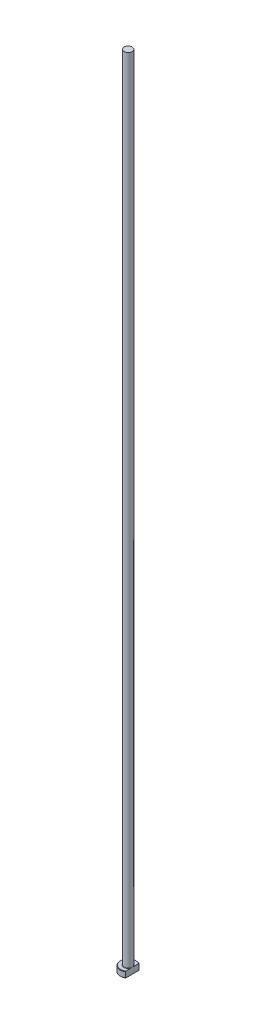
ISO-10303-21;
HEADER;
FILE_DESCRIPTION(('STEP AP214'),'2;1');
FILE_NAME('part.step','',(''),(''),'','','');
FILE_SCHEMA(('AUTOMOTIVE_DESIGN { 1 0 10303 214 1 1 1 1 }'));
ENDSEC;
DATA;
#1=APPLICATION_CONTEXT('core data for automotive mechanical design processes');
#2=APPLICATION_PROTOCOL_DEFINITION('international standard','automotive_design',2000,#1);
#3=PRODUCT_CONTEXT('',#1,'mechanical');
#4=PRODUCT('Part','Part','',(#3));
#5=PRODUCT_RELATED_PRODUCT_CATEGORY('part','',(#4));
#6=PRODUCT_DEFINITION_FORMATION('','',#4);
#7=PRODUCT_DEFINITION_CONTEXT('part definition',#1,'design');
#8=PRODUCT_DEFINITION('design','',#6,#7);
#9=PRODUCT_DEFINITION_SHAPE('','',#8);
#10=(LENGTH_UNIT() NAMED_UNIT(*) SI_UNIT(.MILLI.,.METRE.));
#11=(NAMED_UNIT(*) PLANE_ANGLE_UNIT() SI_UNIT($,.RADIAN.));
#12=(NAMED_UNIT(*) SI_UNIT($,.STERADIAN.) SOLID_ANGLE_UNIT());
#13=UNCERTAINTY_MEASURE_WITH_UNIT(LENGTH_MEASURE(1.E-05),#10,'distance_accuracy_value','');
#14=(GEOMETRIC_REPRESENTATION_CONTEXT(3) GLOBAL_UNCERTAINTY_ASSIGNED_CONTEXT((#13)) GLOBAL_UNIT_ASSIGNED_CONTEXT((#10,
#11,#12)) REPRESENTATION_CONTEXT('',''));
#15=CARTESIAN_POINT('',(0.,0.,0.));
#16=DIRECTION('',(0.,0.,1.));
#17=DIRECTION('',(1.,0.,0.));
#18=AXIS2_PLACEMENT_3D('',#15,#16,#17);
#19=CARTESIAN_POINT('',(0.,0.,0.));
#20=DIRECTION('',(0.,-1.,0.));
#21=DIRECTION('',(0.,0.,-1.));
#22=AXIS2_PLACEMENT_3D('',#19,#20,#21);
#23=PLANE('',#22);
#24=CARTESIAN_POINT('',(0.,0.,0.));
#25=DIRECTION('',(0.,-1.,0.));
#26=DIRECTION('',(0.,0.,-1.));
#27=AXIS2_PLACEMENT_3D('',#24,#25,#26);
#28=CIRCLE('',#27,3.80000000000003);
#29=CARTESIAN_POINT('',(1.99999999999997,0.,3.23109888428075));
#30=VERTEX_POINT('',#29);
#31=CARTESIAN_POINT('',(1.99999999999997,0.,-3.23109888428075));
#32=VERTEX_POINT('',#31);
#33=EDGE_CURVE('E98',#30,#32,#28,.T.);
#34=ORIENTED_EDGE('',*,*,#33,.T.);
#35=DIRECTION('',(0.,0.,1.));
#36=VECTOR('',#35,1.);
#37=CARTESIAN_POINT('',(1.99999999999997,0.,-3.46410161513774));
#38=LINE('',#37,#36);
#39=EDGE_CURVE('E83',#32,#30,#38,.T.);
#40=ORIENTED_EDGE('',*,*,#39,.T.);
#41=EDGE_LOOP('',(#34,#40));
#42=FACE_BOUND('',#41,.T.);
#43=ADVANCED_FACE('F32',(#42),#23,.T.);
#44=CARTESIAN_POINT('',(0.,259.958771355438,0.));
#45=DIRECTION('',(0.,1.,0.));
#46=DIRECTION('',(0.,0.,1.));
#47=AXIS2_PLACEMENT_3D('',#44,#45,#46);
#48=CYLINDRICAL_SURFACE('',#47,3.99999999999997);
#49=CARTESIAN_POINT('',(0.,2.80000000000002,0.));
#50=DIRECTION('',(0.,1.,0.));
#51=DIRECTION('',(0.,0.,1.));
#52=AXIS2_PLACEMENT_3D('',#49,#50,#51);
#53=CIRCLE('',#52,3.99999999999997);
#54=CARTESIAN_POINT('',(1.99999999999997,2.80000000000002,3.46410161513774));
#55=VERTEX_POINT('',#54);
#56=CARTESIAN_POINT('',(1.99999999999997,2.80000000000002,-3.46410161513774));
#57=VERTEX_POINT('',#56);
#58=EDGE_CURVE('E104',#55,#57,#53,.F.);
#59=ORIENTED_EDGE('',*,*,#58,.T.);
#60=DIRECTION('',(0.,-1.,0.));
#61=VECTOR('',#60,1.);
#62=CARTESIAN_POINT('',(1.99999999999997,400.,-3.46410161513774));
#63=LINE('',#62,#61);
#64=CARTESIAN_POINT('',(1.99999999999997,0.199999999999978,-3.46410161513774));
#65=VERTEX_POINT('',#64);
#66=EDGE_CURVE('E183',#57,#65,#63,.T.);
#67=ORIENTED_EDGE('',*,*,#66,.T.);
#68=CARTESIAN_POINT('',(0.,0.199999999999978,0.));
#69=DIRECTION('',(0.,-1.,0.));
#70=DIRECTION('',(0.,0.,-1.));
#71=AXIS2_PLACEMENT_3D('',#68,#69,#70);
#72=CIRCLE('',#71,3.99999999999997);
#73=CARTESIAN_POINT('',(1.99999999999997,0.199999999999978,3.46410161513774));
#74=VERTEX_POINT('',#73);
#75=EDGE_CURVE('E100',#65,#74,#72,.F.);
#76=ORIENTED_EDGE('',*,*,#75,.T.);
#77=DIRECTION('',(0.,-1.,0.));
#78=VECTOR('',#77,1.);
#79=CARTESIAN_POINT('',(1.99999999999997,400.,3.46410161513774));
#80=LINE('',#79,#78);
#81=EDGE_CURVE('E93',#55,#74,#80,.T.);
#82=ORIENTED_EDGE('',*,*,#81,.F.);
#83=EDGE_LOOP('',(#59,#67,#76,#82));
#84=FACE_BOUND('',#83,.T.);
#85=ADVANCED_FACE('F158',(#84),#48,.T.);
#86=CARTESIAN_POINT('',(-3.99999999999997,3.,0.));
#87=DIRECTION('',(0.,1.,0.));
#88=DIRECTION('',(0.,0.,1.));
#89=AXIS2_PLACEMENT_3D('',#86,#87,#88);
#90=PLANE('',#89);
#91=CARTESIAN_POINT('',(0.,3.,0.));
#92=DIRECTION('',(0.,1.,0.));
#93=DIRECTION('',(0.,0.,1.));
#94=AXIS2_PLACEMENT_3D('',#91,#92,#93);
#95=CIRCLE('',#94,3.80000000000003);
#96=CARTESIAN_POINT('',(1.99999999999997,3.,-3.23109888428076));
#97=VERTEX_POINT('',#96);
#98=CARTESIAN_POINT('',(1.99999999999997,3.,3.23109888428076));
#99=VERTEX_POINT('',#98);
#100=EDGE_CURVE('E178',#97,#99,#95,.T.);
#101=ORIENTED_EDGE('',*,*,#100,.T.);
#102=DIRECTION('',(0.,0.,-1.));
#103=VECTOR('',#102,1.);
#104=CARTESIAN_POINT('',(1.99999999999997,3.,0.));
#105=LINE('',#104,#103);
#106=CARTESIAN_POINT('',(1.99999999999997,2.99999999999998,0.916515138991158));
#107=VERTEX_POINT('',#106);
#108=EDGE_CURVE('E57',#99,#107,#105,.T.);
#109=ORIENTED_EDGE('',*,*,#108,.T.);
#110=CARTESIAN_POINT('',(0.,3.,0.));
#111=DIRECTION('',(0.,1.,0.));
#112=DIRECTION('',(0.,0.,1.));
#113=AXIS2_PLACEMENT_3D('',#110,#111,#112);
#114=CIRCLE('',#113,2.19999999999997);
#115=CARTESIAN_POINT('',(1.99999999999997,2.99999999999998,-0.9165151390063));
#116=VERTEX_POINT('',#115);
#117=EDGE_CURVE('E107',#107,#116,#114,.F.);
#118=ORIENTED_EDGE('',*,*,#117,.T.);
#119=EDGE_CURVE('E136',#116,#97,#105,.T.);
#120=ORIENTED_EDGE('',*,*,#119,.T.);
#121=EDGE_LOOP('',(#101,#109,#118,#120));
#122=FACE_BOUND('',#121,.T.);
#123=ADVANCED_FACE('F147',(#122),#90,.T.);
#124=CARTESIAN_POINT('',(0.,3.,0.));
#125=DIRECTION('',(0.,-1.,0.));
#126=DIRECTION('',(0.,0.,-1.));
#127=AXIS2_PLACEMENT_3D('',#124,#125,#126);
#128=CONICAL_SURFACE('',#127,3.80000000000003,0.785398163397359);
#129=ORIENTED_EDGE('',*,*,#58,.F.);
#130=CARTESIAN_POINT('',(1.99999999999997,-1.08095467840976,7.62295524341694));
#131=CARTESIAN_POINT('',(1.99999999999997,-0.913887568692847,7.4502239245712));
#132=CARTESIAN_POINT('',(1.99999999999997,-0.746999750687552,7.27731861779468));
#133=CARTESIAN_POINT('',(1.99999999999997,-0.41368874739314,6.93105655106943));
#134=CARTESIAN_POINT('',(1.99999999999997,-0.247265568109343,6.75769978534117));
#135=CARTESIAN_POINT('',(1.99999999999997,0.08509080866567,6.41034692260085));
#136=CARTESIAN_POINT('',(1.99999999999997,0.251023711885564,6.23635054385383));
#137=CARTESIAN_POINT('',(1.99999999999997,0.582155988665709,5.88766284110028));
#138=CARTESIAN_POINT('',(1.99999999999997,0.747355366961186,5.71297152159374));
#139=CARTESIAN_POINT('',(1.99999999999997,1.0735385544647,5.36616839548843));
#140=CARTESIAN_POINT('',(1.99999999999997,1.23454099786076,5.19407412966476));
#141=CARTESIAN_POINT('',(1.99999999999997,1.55534102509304,4.8487666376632));
#142=CARTESIAN_POINT('',(1.99999999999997,1.71513861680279,4.67555341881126));
#143=CARTESIAN_POINT('',(1.99999999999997,2.0330618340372,4.3276656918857));
#144=CARTESIAN_POINT('',(1.99999999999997,2.19118781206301,4.15299150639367));
#145=CARTESIAN_POINT('',(1.99999999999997,2.50513944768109,3.80159134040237));
#146=CARTESIAN_POINT('',(1.99999999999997,2.66096519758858,3.62486544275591));
#147=CARTESIAN_POINT('',(1.99999999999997,2.90974646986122,3.33722425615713));
#148=CARTESIAN_POINT('',(1.99999999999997,3.00376148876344,3.22722645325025));
#149=CARTESIAN_POINT('',(1.99999999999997,3.19011825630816,3.00579987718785));
#150=CARTESIAN_POINT('',(1.99999999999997,3.28245983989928,2.89437096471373));
#151=CARTESIAN_POINT('',(1.99999999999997,3.46586188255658,2.66849662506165));
#152=CARTESIAN_POINT('',(1.99999999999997,3.55689849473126,2.55403176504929));
#153=CARTESIAN_POINT('',(1.99999999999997,3.73578809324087,2.32266819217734));
#154=CARTESIAN_POINT('',(1.99999999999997,3.82364184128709,2.20577007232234));
#155=CARTESIAN_POINT('',(1.99999999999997,3.99612756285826,1.96688707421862));
#156=CARTESIAN_POINT('',(1.99999999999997,4.08069035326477,1.84485190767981));
#157=CARTESIAN_POINT('',(1.99999999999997,4.24300264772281,1.59599329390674));
#158=CARTESIAN_POINT('',(1.99999999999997,4.32074277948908,1.46916359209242));
#159=CARTESIAN_POINT('',(1.99999999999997,4.42869763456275,1.27510066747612));
#160=CARTESIAN_POINT('',(1.99999999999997,4.46305374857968,1.2101894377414));
#161=CARTESIAN_POINT('',(1.99999999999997,4.52837146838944,1.07868835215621));
#162=CARTESIAN_POINT('',(1.99999999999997,4.55933245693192,1.01209819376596));
#163=CARTESIAN_POINT('',(1.99999999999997,4.6456686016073,0.80989435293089));
#164=CARTESIAN_POINT('',(1.99999999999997,4.69478214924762,0.671360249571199));
#165=CARTESIAN_POINT('',(1.99999999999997,4.74794829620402,0.463657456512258));
#166=CARTESIAN_POINT('',(1.99999999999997,4.76205065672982,0.397033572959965));
#167=CARTESIAN_POINT('',(1.99999999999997,4.78390371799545,0.262728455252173));
#168=CARTESIAN_POINT('',(1.99999999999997,4.79165498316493,0.195047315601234));
#169=CARTESIAN_POINT('',(1.99999999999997,4.80025690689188,0.0594528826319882));
#170=CARTESIAN_POINT('',(1.99999999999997,4.80112894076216,-0.00845903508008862));
#171=CARTESIAN_POINT('',(1.99999999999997,4.79596585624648,-0.144020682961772));
#172=CARTESIAN_POINT('',(1.99999999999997,4.78993016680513,-0.211670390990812));
#173=CARTESIAN_POINT('',(1.99999999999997,4.77145363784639,-0.345483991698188));
#174=CARTESIAN_POINT('',(1.99999999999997,4.75906777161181,-0.41165563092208));
#175=CARTESIAN_POINT('',(1.99999999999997,4.72866360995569,-0.542678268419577));
#176=CARTESIAN_POINT('',(1.99999999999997,4.71064463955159,-0.607529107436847));
#177=CARTESIAN_POINT('',(1.99999999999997,4.66972939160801,-0.736064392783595));
#178=CARTESIAN_POINT('',(1.99999999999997,4.64680564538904,-0.799739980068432));
#179=CARTESIAN_POINT('',(1.99999999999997,4.59700147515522,-0.925489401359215));
#180=CARTESIAN_POINT('',(1.99999999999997,4.57012185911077,-0.98756355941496));
#181=CARTESIAN_POINT('',(1.99999999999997,4.48443518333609,-1.17209020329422));
#182=CARTESIAN_POINT('',(1.99999999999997,4.42077407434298,-1.29228210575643));
#183=CARTESIAN_POINT('',(1.99999999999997,4.28502644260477,-1.52785770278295));
#184=CARTESIAN_POINT('',(1.99999999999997,4.21292931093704,-1.6432350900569));
#185=CARTESIAN_POINT('',(1.99999999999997,4.0628151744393,-1.87069387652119));
#186=CARTESIAN_POINT('',(1.99999999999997,3.98477595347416,-1.98276048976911));
#187=CARTESIAN_POINT('',(1.99999999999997,3.8248197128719,-2.20397837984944));
#188=CARTESIAN_POINT('',(1.99999999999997,3.74290465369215,-2.31313108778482));
#189=CARTESIAN_POINT('',(1.99999999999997,3.57517222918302,-2.53068545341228));
#190=CARTESIAN_POINT('',(1.99999999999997,3.48931769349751,-2.63905831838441));
#191=CARTESIAN_POINT('',(1.99999999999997,3.3154815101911,-2.85409686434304));
#192=CARTESIAN_POINT('',(1.99999999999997,3.22749963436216,-2.96076236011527));
#193=CARTESIAN_POINT('',(1.99999999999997,3.05015030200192,-3.17249211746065));
#194=CARTESIAN_POINT('',(1.99999999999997,2.96078672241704,-3.27755963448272));
#195=CARTESIAN_POINT('',(1.99999999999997,2.78082366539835,-3.48663191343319));
#196=CARTESIAN_POINT('',(1.99999999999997,2.69022416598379,-3.59063665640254));
#197=CARTESIAN_POINT('',(1.99999999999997,2.44796733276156,-3.86612439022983));
#198=CARTESIAN_POINT('',(1.99999999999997,2.29545972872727,-4.0368591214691));
#199=CARTESIAN_POINT('',(1.99999999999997,1.98858070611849,-4.37664803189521));
#200=CARTESIAN_POINT('',(1.99999999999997,1.83420923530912,-4.54570216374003));
#201=CARTESIAN_POINT('',(1.99999999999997,1.52396102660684,-4.88271638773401));
#202=CARTESIAN_POINT('',(1.99999999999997,1.36808300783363,-5.05067529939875));
#203=CARTESIAN_POINT('',(1.99999999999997,1.05530513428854,-5.38563883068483));
#204=CARTESIAN_POINT('',(1.99999999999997,0.898405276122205,-5.55264344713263));
#205=CARTESIAN_POINT('',(1.99999999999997,0.590290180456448,-5.87905385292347));
#206=CARTESIAN_POINT('',(1.99999999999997,0.439106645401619,-6.03848959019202));
#207=CARTESIAN_POINT('',(1.99999999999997,0.136164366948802,-6.3568145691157));
#208=CARTESIAN_POINT('',(1.99999999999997,-0.0155943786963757,-6.51570380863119));
#209=CARTESIAN_POINT('',(1.99999999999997,-0.319404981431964,-6.83286192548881));
#210=CARTESIAN_POINT('',(1.99999999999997,-0.471456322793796,-6.99113129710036));
#211=CARTESIAN_POINT('',(1.99999999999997,-0.775939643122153,-7.30730102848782));
#212=CARTESIAN_POINT('',(1.99999999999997,-0.928371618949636,-7.46520139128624));
#213=CARTESIAN_POINT('',(1.99999999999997,-1.08095467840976,-7.62295524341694));
#214=B_SPLINE_CURVE_WITH_KNOTS('',3,(#130,#131,#132,#133,#134,#135,#136,#137,#138,#139,#140,
#141,#142,#143,#144,#145,#146,#147,#148,#149,#150,#151,#152,#153,#154,#155,#156,#157,#158,#159,
#160,#161,#162,#163,#164,#165,#166,#167,#168,#169,#170,#171,#172,#173,#174,#175,#176,#177,#178,
#179,#180,#181,#182,#183,#184,#185,#186,#187,#188,#189,#190,#191,#192,#193,#194,#195,#196,#197,
#198,#199,#200,#201,#202,#203,#204,#205,#206,#207,#208,#209,#210,#211,#212,#213),.UNSPECIFIED.,
.F.,.F.,(4,2,2,2,2,2,2,2,2,2,2,2,2,2,2,2,2,2,2,2,2,2,2,2,2,2,2,2,2,2,2,2,2,2,2,2,2,2,2,2,2,4),
(0.,0.720921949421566,1.44185317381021,2.16315326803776,2.88444869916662,3.59144103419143,
4.29842874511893,5.00526427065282,5.71207135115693,6.14616174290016,6.58029471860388,
7.01901494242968,7.45762947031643,7.90290456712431,8.34878206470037,8.56901415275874,
8.78928621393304,9.22814472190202,9.43219512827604,9.63622739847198,9.83962544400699,
10.0430403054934,10.244723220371,10.4464303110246,10.6492980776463,10.8521244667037,
11.2595582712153,11.6675100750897,12.0770700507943,12.4864250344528,12.9011677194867,
13.3159550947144,13.7297367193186,14.1435257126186,14.8302935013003,15.5170805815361,
16.2045145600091,16.891950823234,17.5511045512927,18.2102608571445,18.8686819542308,
19.5270976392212),.UNSPECIFIED.);
#215=EDGE_CURVE('E135',#55,#99,#214,.T.);
#216=ORIENTED_EDGE('',*,*,#215,.T.);
#217=ORIENTED_EDGE('',*,*,#100,.F.);
#218=EDGE_CURVE('E127',#97,#57,#214,.T.);
#219=ORIENTED_EDGE('',*,*,#218,.T.);
#220=EDGE_LOOP('',(#129,#216,#217,#219));
#221=FACE_BOUND('',#220,.T.);
#222=ADVANCED_FACE('F143',(#221),#128,.T.);
#223=CARTESIAN_POINT('',(0.,0.199999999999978,0.));
#224=DIRECTION('',(0.,1.,0.));
#225=DIRECTION('',(0.,0.,1.));
#226=AXIS2_PLACEMENT_3D('',#223,#224,#225);
#227=CONICAL_SURFACE('',#226,3.99999999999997,0.785398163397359);
#228=ORIENTED_EDGE('',*,*,#75,.F.);
#229=CARTESIAN_POINT('',(1.99999999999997,4.08095467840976,-7.62295524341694));
#230=CARTESIAN_POINT('',(1.99999999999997,3.91388756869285,-7.4502239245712));
#231=CARTESIAN_POINT('',(1.99999999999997,3.74699975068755,-7.27731861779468));
#232=CARTESIAN_POINT('',(1.99999999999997,3.41368874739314,-6.93105655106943));
#233=CARTESIAN_POINT('',(1.99999999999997,3.24726556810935,-6.75769978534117));
#234=CARTESIAN_POINT('',(1.99999999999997,2.91490919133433,-6.41034692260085));
#235=CARTESIAN_POINT('',(1.99999999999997,2.74897628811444,-6.23635054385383));
#236=CARTESIAN_POINT('',(1.99999999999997,2.4178440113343,-5.88766284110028));
#237=CARTESIAN_POINT('',(1.99999999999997,2.25264463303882,-5.71297152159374));
#238=CARTESIAN_POINT('',(1.99999999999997,1.9264614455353,-5.36616839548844));
#239=CARTESIAN_POINT('',(1.99999999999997,1.76545900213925,-5.19407412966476));
#240=CARTESIAN_POINT('',(1.99999999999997,1.44465897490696,-4.8487666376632));
#241=CARTESIAN_POINT('',(1.99999999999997,1.28486138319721,-4.67555341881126));
#242=CARTESIAN_POINT('',(1.99999999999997,0.966938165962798,-4.3276656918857));
#243=CARTESIAN_POINT('',(1.99999999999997,0.80881218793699,-4.15299150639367));
#244=CARTESIAN_POINT('',(1.99999999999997,0.494860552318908,-3.80159134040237));
#245=CARTESIAN_POINT('',(1.99999999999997,0.339034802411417,-3.62486544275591));
#246=CARTESIAN_POINT('',(1.99999999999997,0.090253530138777,-3.33722425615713));
#247=CARTESIAN_POINT('',(1.99999999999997,-0.00376148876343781,-3.22722645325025));
#248=CARTESIAN_POINT('',(1.99999999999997,-0.190118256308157,-3.00579987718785));
#249=CARTESIAN_POINT('',(1.99999999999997,-0.282459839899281,-2.89437096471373));
#250=CARTESIAN_POINT('',(1.99999999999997,-0.465861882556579,-2.66849662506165));
#251=CARTESIAN_POINT('',(1.99999999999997,-0.556898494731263,-2.55403176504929));
#252=CARTESIAN_POINT('',(1.99999999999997,-0.735788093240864,-2.32266819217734));
#253=CARTESIAN_POINT('',(1.99999999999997,-0.823641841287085,-2.20577007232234));
#254=CARTESIAN_POINT('',(1.99999999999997,-0.996127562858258,-1.96688707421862));
#255=CARTESIAN_POINT('',(1.99999999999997,-1.08069035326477,-1.84485190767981));
#256=CARTESIAN_POINT('',(1.99999999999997,-1.24300264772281,-1.59599329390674));
#257=CARTESIAN_POINT('',(1.99999999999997,-1.32074277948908,-1.46916359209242));
#258=CARTESIAN_POINT('',(1.99999999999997,-1.42869763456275,-1.27510066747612));
#259=CARTESIAN_POINT('',(1.99999999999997,-1.46305374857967,-1.21018943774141));
#260=CARTESIAN_POINT('',(1.99999999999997,-1.52837146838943,-1.07868835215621));
#261=CARTESIAN_POINT('',(1.99999999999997,-1.55933245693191,-1.01209819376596));
#262=CARTESIAN_POINT('',(1.99999999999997,-1.64566860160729,-0.809894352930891));
#263=CARTESIAN_POINT('',(1.99999999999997,-1.69478214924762,-0.671360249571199));
#264=CARTESIAN_POINT('',(1.99999999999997,-1.74794829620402,-0.463657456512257));
#265=CARTESIAN_POINT('',(1.99999999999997,-1.76205065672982,-0.397033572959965));
#266=CARTESIAN_POINT('',(1.99999999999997,-1.78390371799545,-0.262728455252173));
#267=CARTESIAN_POINT('',(1.99999999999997,-1.79165498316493,-0.195047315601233));
#268=CARTESIAN_POINT('',(1.99999999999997,-1.80025690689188,-0.0594528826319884));
#269=CARTESIAN_POINT('',(1.99999999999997,-1.80112894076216,0.00845903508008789));
#270=CARTESIAN_POINT('',(1.99999999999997,-1.79596585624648,0.144020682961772));
#271=CARTESIAN_POINT('',(1.99999999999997,-1.78993016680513,0.211670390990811));
#272=CARTESIAN_POINT('',(1.99999999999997,-1.77145363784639,0.345483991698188));
#273=CARTESIAN_POINT('',(1.99999999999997,-1.75906777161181,0.411655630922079));
#274=CARTESIAN_POINT('',(1.99999999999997,-1.72866360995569,0.542678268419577));
#275=CARTESIAN_POINT('',(1.99999999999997,-1.71064463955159,0.607529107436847));
#276=CARTESIAN_POINT('',(1.99999999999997,-1.66972939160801,0.736064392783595));
#277=CARTESIAN_POINT('',(1.99999999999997,-1.64680564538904,0.799739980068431));
#278=CARTESIAN_POINT('',(1.99999999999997,-1.59700147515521,0.925489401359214));
#279=CARTESIAN_POINT('',(1.99999999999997,-1.57012185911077,0.98756355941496));
#280=CARTESIAN_POINT('',(1.99999999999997,-1.48443518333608,1.17209020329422));
#281=CARTESIAN_POINT('',(1.99999999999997,-1.42077407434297,1.29228210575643));
#282=CARTESIAN_POINT('',(1.99999999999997,-1.28502644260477,1.52785770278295));
#283=CARTESIAN_POINT('',(1.99999999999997,-1.21292931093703,1.6432350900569));
#284=CARTESIAN_POINT('',(1.99999999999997,-1.06281517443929,1.87069387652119));
#285=CARTESIAN_POINT('',(1.99999999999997,-0.984775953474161,1.98276048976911));
#286=CARTESIAN_POINT('',(1.99999999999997,-0.824819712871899,2.20397837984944));
#287=CARTESIAN_POINT('',(1.99999999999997,-0.742904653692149,2.31313108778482));
#288=CARTESIAN_POINT('',(1.99999999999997,-0.575172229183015,2.53068545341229));
#289=CARTESIAN_POINT('',(1.99999999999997,-0.489317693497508,2.63905831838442));
#290=CARTESIAN_POINT('',(1.99999999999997,-0.315481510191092,2.85409686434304));
#291=CARTESIAN_POINT('',(1.99999999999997,-0.22749963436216,2.96076236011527));
#292=CARTESIAN_POINT('',(1.99999999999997,-0.0501503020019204,3.17249211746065));
#293=CARTESIAN_POINT('',(1.99999999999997,0.0392132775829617,3.27755963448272));
#294=CARTESIAN_POINT('',(1.99999999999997,0.219176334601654,3.48663191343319));
#295=CARTESIAN_POINT('',(1.99999999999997,0.30977583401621,3.59063665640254));
#296=CARTESIAN_POINT('',(1.99999999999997,0.552032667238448,3.86612439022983));
#297=CARTESIAN_POINT('',(1.99999999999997,0.704540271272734,4.0368591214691));
#298=CARTESIAN_POINT('',(1.99999999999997,1.01141929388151,4.37664803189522));
#299=CARTESIAN_POINT('',(1.99999999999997,1.16579076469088,4.54570216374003));
#300=CARTESIAN_POINT('',(1.99999999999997,1.47603897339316,4.88271638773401));
#301=CARTESIAN_POINT('',(1.99999999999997,1.63191699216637,5.05067529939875));
#302=CARTESIAN_POINT('',(1.99999999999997,1.94469486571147,5.38563883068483));
#303=CARTESIAN_POINT('',(1.99999999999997,2.1015947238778,5.55264344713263));
#304=CARTESIAN_POINT('',(1.99999999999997,2.40970981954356,5.87905385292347));
#305=CARTESIAN_POINT('',(1.99999999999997,2.56089335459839,6.03848959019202));
#306=CARTESIAN_POINT('',(1.99999999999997,2.8638356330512,6.35681456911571));
#307=CARTESIAN_POINT('',(1.99999999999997,3.01559437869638,6.51570380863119));
#308=CARTESIAN_POINT('',(1.99999999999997,3.31940498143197,6.83286192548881));
#309=CARTESIAN_POINT('',(1.99999999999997,3.4714563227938,6.99113129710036));
#310=CARTESIAN_POINT('',(1.99999999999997,3.77593964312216,7.30730102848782));
#311=CARTESIAN_POINT('',(1.99999999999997,3.92837161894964,7.46520139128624));
#312=CARTESIAN_POINT('',(1.99999999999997,4.08095467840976,7.62295524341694));
#313=B_SPLINE_CURVE_WITH_KNOTS('',3,(#229,#230,#231,#232,#233,#234,#235,#236,#237,#238,#239,
#240,#241,#242,#243,#244,#245,#246,#247,#248,#249,#250,#251,#252,#253,#254,#255,#256,#257,#258,
#259,#260,#261,#262,#263,#264,#265,#266,#267,#268,#269,#270,#271,#272,#273,#274,#275,#276,#277,
#278,#279,#280,#281,#282,#283,#284,#285,#286,#287,#288,#289,#290,#291,#292,#293,#294,#295,#296,
#297,#298,#299,#300,#301,#302,#303,#304,#305,#306,#307,#308,#309,#310,#311,#312),.UNSPECIFIED.,
.F.,.F.,(4,2,2,2,2,2,2,2,2,2,2,2,2,2,2,2,2,2,2,2,2,2,2,2,2,2,2,2,2,2,2,2,2,2,2,2,2,2,2,2,2,4),
(0.,0.720921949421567,1.4418531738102,2.16315326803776,2.88444869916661,3.59144103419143,
4.29842874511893,5.00526427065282,5.71207135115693,6.14616174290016,6.58029471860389,
7.01901494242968,7.45762947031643,7.90290456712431,8.34878206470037,8.56901415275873,
8.78928621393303,9.22814472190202,9.43219512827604,9.63622739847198,9.83962544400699,
10.0430403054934,10.244723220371,10.4464303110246,10.6492980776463,10.8521244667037,
11.2595582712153,11.6675100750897,12.0770700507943,12.4864250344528,12.9011677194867,
13.3159550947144,13.7297367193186,14.1435257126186,14.8302935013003,15.5170805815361,
16.2045145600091,16.891950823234,17.5511045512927,18.2102608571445,18.8686819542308,
19.5270976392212),.UNSPECIFIED.);
#314=EDGE_CURVE('E86',#65,#32,#313,.T.);
#315=ORIENTED_EDGE('',*,*,#314,.T.);
#316=ORIENTED_EDGE('',*,*,#33,.F.);
#317=EDGE_CURVE('E89',#30,#74,#313,.T.);
#318=ORIENTED_EDGE('',*,*,#317,.T.);
#319=EDGE_LOOP('',(#228,#315,#316,#318));
#320=FACE_BOUND('',#319,.T.);
#321=ADVANCED_FACE('F97',(#320),#227,.T.);
#322=CARTESIAN_POINT('',(0.,3.19999999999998,0.));
#323=DIRECTION('',(0.,1.,0.));
#324=DIRECTION('',(0.,0.,1.));
#325=AXIS2_PLACEMENT_3D('',#322,#323,#324);
#326=TOROIDAL_SURFACE('',#325,2.19999999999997,0.2);
#327=CARTESIAN_POINT('',(1.99999999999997,3.19999999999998,0.));
#328=CARTESIAN_POINT('',(1.99999999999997,3.20000050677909,1.13930257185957E-10));
#329=CARTESIAN_POINT('',(1.99999999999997,3.20000101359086,-1.46766790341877E-07));
#330=CARTESIAN_POINT('',(1.99999999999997,3.20000197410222,-5.82067439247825E-07));
#331=CARTESIAN_POINT('',(1.99999999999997,3.20000242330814,-8.77873003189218E-07));
#332=CARTESIAN_POINT('',(1.99999999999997,3.20000333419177,-1.58424512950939E-06));
#333=CARTESIAN_POINT('',(1.99999999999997,3.20000378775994,-2.00534281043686E-06));
#334=CARTESIAN_POINT('',(1.99999999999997,3.20000462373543,-2.89558838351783E-06));
#335=CARTESIAN_POINT('',(1.99999999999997,3.20000500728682,-3.3637232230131E-06));
#336=CARTESIAN_POINT('',(1.99999999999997,3.20000636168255,-5.10887545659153E-06));
#337=CARTESIAN_POINT('',(1.99999999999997,3.2000072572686,-6.44597273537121E-06));
#338=CARTESIAN_POINT('',(1.99999999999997,3.20000879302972,-9.14926709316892E-06));
#339=CARTESIAN_POINT('',(1.99999999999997,3.20000944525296,-1.05089714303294E-05));
#340=CARTESIAN_POINT('',(1.99999999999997,3.20001204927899,-1.60555879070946E-05));
#341=CARTESIAN_POINT('',(1.99999999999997,3.20001390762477,-2.02908746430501E-05));
#342=CARTESIAN_POINT('',(1.99999999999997,3.20001676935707,-2.84438492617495E-05));
#343=CARTESIAN_POINT('',(1.99999999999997,3.2000178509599,-3.23343257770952E-05));
#344=CARTESIAN_POINT('',(1.99999999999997,3.20002551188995,-6.06027142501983E-05));
#345=CARTESIAN_POINT('',(1.99999999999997,3.20003111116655,-8.51991843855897E-05));
#346=CARTESIAN_POINT('',(1.99999999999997,3.20005559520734,-0.000181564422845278));
#347=CARTESIAN_POINT('',(1.99999999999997,3.20007914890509,-0.00025209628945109));
#348=CARTESIAN_POINT('',(1.99999999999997,3.20017002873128,-0.000529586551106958));
#349=CARTESIAN_POINT('',(1.99999999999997,3.20023415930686,-0.000737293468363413));
#350=CARTESIAN_POINT('',(1.99999999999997,3.20048926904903,-0.00155657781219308));
#351=CARTESIAN_POINT('',(1.99999999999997,3.20068414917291,-0.00216722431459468));
#352=CARTESIAN_POINT('',(1.99999999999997,3.20148805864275,-0.00469384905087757));
#353=CARTESIAN_POINT('',(1.99999999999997,3.20209226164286,-0.00661098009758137));
#354=CARTESIAN_POINT('',(1.99999999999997,3.20822779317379,-0.026069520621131));
#355=CARTESIAN_POINT('',(1.99999999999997,3.21378174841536,-0.0436057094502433));
#356=CARTESIAN_POINT('',(1.99999999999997,3.22462834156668,-0.0780127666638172));
#357=CARTESIAN_POINT('',(1.99999999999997,3.2299227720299,-0.0948831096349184));
#358=CARTESIAN_POINT('',(1.99999999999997,3.24110477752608,-0.130713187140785));
#359=CARTESIAN_POINT('',(1.99999999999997,3.24698536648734,-0.149675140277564));
#360=CARTESIAN_POINT('',(1.99999999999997,3.2586983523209,-0.187834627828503));
#361=CARTESIAN_POINT('',(1.99999999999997,3.26452957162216,-0.207032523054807));
#362=CARTESIAN_POINT('',(1.99999999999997,3.27861584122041,-0.254071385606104));
#363=CARTESIAN_POINT('',(1.99999999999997,3.28678835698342,-0.281937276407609));
#364=CARTESIAN_POINT('',(1.99999999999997,3.30249503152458,-0.337115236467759));
#365=CARTESIAN_POINT('',(1.99999999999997,3.31003989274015,-0.36442425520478));
#366=CARTESIAN_POINT('',(1.99999999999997,3.32554795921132,-0.422841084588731));
#367=CARTESIAN_POINT('',(1.99999999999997,3.33343288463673,-0.453970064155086));
#368=CARTESIAN_POINT('',(1.99999999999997,3.34833120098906,-0.516667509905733));
#369=CARTESIAN_POINT('',(1.99999999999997,3.3553379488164,-0.548237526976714));
#370=CARTESIAN_POINT('',(1.99999999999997,3.37554978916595,-0.647984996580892));
#371=CARTESIAN_POINT('',(1.99999999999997,3.38665117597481,-0.716635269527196));
#372=CARTESIAN_POINT('',(1.99999999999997,3.39785773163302,-0.832445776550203));
#373=CARTESIAN_POINT('',(1.99999999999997,3.40036304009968,-0.879345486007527));
#374=CARTESIAN_POINT('',(1.99999999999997,3.3997602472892,-0.94923898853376));
#375=CARTESIAN_POINT('',(1.99999999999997,3.39886048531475,-0.972248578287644));
#376=CARTESIAN_POINT('',(1.99999999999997,3.39534463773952,-1.01812773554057));
#377=CARTESIAN_POINT('',(1.99999999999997,3.39273014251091,-1.04099741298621));
#378=CARTESIAN_POINT('',(1.99999999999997,3.38623968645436,-1.08102660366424));
#379=CARTESIAN_POINT('',(1.99999999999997,3.38280841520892,-1.09825717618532));
#380=CARTESIAN_POINT('',(1.99999999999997,3.37442567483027,-1.13243508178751));
#381=CARTESIAN_POINT('',(1.99999999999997,3.36946777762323,-1.14938089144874));
#382=CARTESIAN_POINT('',(1.99999999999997,3.35764172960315,-1.18276398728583));
#383=CARTESIAN_POINT('',(1.99999999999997,3.3507581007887,-1.19919590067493));
#384=CARTESIAN_POINT('',(1.99999999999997,3.33462082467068,-1.23083581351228));
#385=CARTESIAN_POINT('',(1.99999999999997,3.32537783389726,-1.24604892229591));
#386=CARTESIAN_POINT('',(1.99999999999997,3.30929159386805,-1.26715296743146));
#387=CARTESIAN_POINT('',(1.99999999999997,3.30356769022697,-1.27389441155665));
#388=CARTESIAN_POINT('',(1.99999999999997,3.29128925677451,-1.28659894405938));
#389=CARTESIAN_POINT('',(1.99999999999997,3.28473413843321,-1.2925614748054));
#390=CARTESIAN_POINT('',(1.99999999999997,3.27066594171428,-1.30346436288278));
#391=CARTESIAN_POINT('',(1.99999999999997,3.26314132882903,-1.30839014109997));
#392=CARTESIAN_POINT('',(1.99999999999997,3.24727957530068,-1.31668687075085));
#393=CARTESIAN_POINT('',(1.99999999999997,3.23894498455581,-1.32006252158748));
#394=CARTESIAN_POINT('',(1.99999999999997,3.22424089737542,-1.3241557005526));
#395=CARTESIAN_POINT('',(1.99999999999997,3.21800630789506,-1.32536112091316));
#396=CARTESIAN_POINT('',(1.99999999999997,3.20542266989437,-1.32669615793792));
#397=CARTESIAN_POINT('',(1.99999999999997,3.19907368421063,-1.32682634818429));
#398=CARTESIAN_POINT('',(1.99999999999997,3.18645152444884,-1.32599950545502));
#399=CARTESIAN_POINT('',(1.99999999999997,3.18017831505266,-1.32504300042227));
#400=CARTESIAN_POINT('',(1.99999999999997,3.16787181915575,-1.32212308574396));
#401=CARTESIAN_POINT('',(1.99999999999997,3.16183869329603,-1.3201590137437));
#402=CARTESIAN_POINT('',(1.99999999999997,3.14844260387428,-1.3146656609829));
#403=CARTESIAN_POINT('',(1.99999999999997,3.14119825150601,-1.31084826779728));
#404=CARTESIAN_POINT('',(1.99999999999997,3.12742328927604,-1.30209252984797));
#405=CARTESIAN_POINT('',(1.99999999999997,3.12089414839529,-1.2971519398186));
#406=CARTESIAN_POINT('',(1.99999999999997,3.10554761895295,-1.28382084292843));
#407=CARTESIAN_POINT('',(1.99999999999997,3.09717242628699,-1.27492468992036));
#408=CARTESIAN_POINT('',(1.99999999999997,3.08188323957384,-1.25597903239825));
#409=CARTESIAN_POINT('',(1.99999999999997,3.07497120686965,-1.24592800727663));
#410=CARTESIAN_POINT('',(1.99999999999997,3.05771073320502,-1.21734573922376));
#411=CARTESIAN_POINT('',(1.99999999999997,3.04862251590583,-1.19806017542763));
#412=CARTESIAN_POINT('',(1.99999999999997,3.03323781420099,-1.15830155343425));
#413=CARTESIAN_POINT('',(1.99999999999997,3.02696471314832,-1.13782009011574));
#414=CARTESIAN_POINT('',(1.99999999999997,3.0165915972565,-1.09607450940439));
#415=CARTESIAN_POINT('',(1.99999999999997,3.0125177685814,-1.07480405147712));
#416=CARTESIAN_POINT('',(1.99999999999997,3.00618909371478,-1.03196822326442));
#417=CARTESIAN_POINT('',(1.99999999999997,3.00393768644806,-1.01040237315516));
#418=CARTESIAN_POINT('',(1.99999999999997,2.99950887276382,-0.94694819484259));
#419=CARTESIAN_POINT('',(1.99999999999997,2.99937097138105,-0.904921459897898));
#420=CARTESIAN_POINT('',(1.99999999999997,3.00391139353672,-0.800067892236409));
#421=CARTESIAN_POINT('',(1.99999999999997,3.01103947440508,-0.7373784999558));
#422=CARTESIAN_POINT('',(1.99999999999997,3.0310998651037,-0.611444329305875));
#423=CARTESIAN_POINT('',(1.99999999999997,3.04417074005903,-0.548223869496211));
#424=CARTESIAN_POINT('',(1.99999999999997,3.06920011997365,-0.442888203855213));
#425=CARTESIAN_POINT('',(1.99999999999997,3.08016343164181,-0.40052705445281));
#426=CARTESIAN_POINT('',(1.99999999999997,3.10315303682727,-0.316588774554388));
#427=CARTESIAN_POINT('',(1.99999999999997,3.11516655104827,-0.275008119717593));
#428=CARTESIAN_POINT('',(1.99999999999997,3.13853403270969,-0.196672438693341));
#429=CARTESIAN_POINT('',(1.99999999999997,3.14981294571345,-0.159894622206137));
#430=CARTESIAN_POINT('',(1.99999999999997,3.17316886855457,-0.0849211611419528));
#431=CARTESIAN_POINT('',(1.99999999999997,3.1852595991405,-0.0467297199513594));
#432=CARTESIAN_POINT('',(1.99999999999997,3.19790869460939,-0.00660765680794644));
#433=CARTESIAN_POINT('',(1.99999999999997,3.19851400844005,-0.00468723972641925));
#434=CARTESIAN_POINT('',(1.99999999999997,3.19931818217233,-0.00215985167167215));
#435=CARTESIAN_POINT('',(1.99999999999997,3.19951225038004,-0.00155173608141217));
#436=CARTESIAN_POINT('',(1.99999999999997,3.19976637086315,-0.000735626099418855));
#437=CARTESIAN_POINT('',(1.99999999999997,3.19983030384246,-0.000528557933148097));
#438=CARTESIAN_POINT('',(1.99999999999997,3.1999209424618,-0.000251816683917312));
#439=CARTESIAN_POINT('',(1.99999999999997,3.19994446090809,-0.000181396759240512));
#440=CARTESIAN_POINT('',(1.99999999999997,3.19996891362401,-8.51622335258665E-05));
#441=CARTESIAN_POINT('',(1.99999999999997,3.19997450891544,-6.05824642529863E-05));
#442=CARTESIAN_POINT('',(1.99999999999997,3.19998216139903,-3.23308900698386E-05));
#443=CARTESIAN_POINT('',(1.99999999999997,3.19998324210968,-2.8441435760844E-05));
#444=CARTESIAN_POINT('',(1.99999999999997,3.19998610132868,-2.02904708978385E-05));
#445=CARTESIAN_POINT('',(1.99999999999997,3.19998795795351,-1.60561197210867E-05));
#446=CARTESIAN_POINT('',(1.99999999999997,3.19999055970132,-1.05104410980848E-05));
#447=CARTESIAN_POINT('',(1.99999999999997,3.19999121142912,-9.15081310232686E-06));
#448=CARTESIAN_POINT('',(1.99999999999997,3.19999274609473,-6.44758190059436E-06));
#449=CARTESIAN_POINT('',(1.99999999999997,3.19999364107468,-5.11046368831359E-06));
#450=CARTESIAN_POINT('',(1.99999999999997,3.19999499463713,-3.36517633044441E-06));
#451=CARTESIAN_POINT('',(1.99999999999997,3.19999537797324,-2.89697952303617E-06));
#452=CARTESIAN_POINT('',(1.99999999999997,3.19999621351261,-2.00657123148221E-06));
#453=CARTESIAN_POINT('',(1.99999999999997,3.19999666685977,-1.58537194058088E-06));
#454=CARTESIAN_POINT('',(1.99999999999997,3.19999757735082,-8.78757202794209E-07));
#455=CARTESIAN_POINT('',(1.99999999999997,3.19999802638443,-5.82817881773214E-07));
#456=CARTESIAN_POINT('',(1.99999999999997,3.19999898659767,-1.47186730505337E-07));
#457=CARTESIAN_POINT('',(1.99999999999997,3.1999994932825,-1.13916400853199E-10));
#458=CARTESIAN_POINT('',(1.99999999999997,3.19999999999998,0.));
#459=B_SPLINE_CURVE_WITH_KNOTS('',3,(#327,#328,#329,#330,#331,#332,#333,#334,#335,#336,#337,
#338,#339,#340,#341,#342,#343,#344,#345,#346,#347,#348,#349,#350,#351,#352,#353,#354,#355,#356,
#357,#358,#359,#360,#361,#362,#363,#364,#365,#366,#367,#368,#369,#370,#371,#372,#373,#374,#375,
#376,#377,#378,#379,#380,#381,#382,#383,#384,#385,#386,#387,#388,#389,#390,#391,#392,#393,#394,
#395,#396,#397,#398,#399,#400,#401,#402,#403,#404,#405,#406,#407,#408,#409,#410,#411,#412,#413,
#414,#415,#416,#417,#418,#419,#420,#421,#422,#423,#424,#425,#426,#427,#428,#429,#430,#431,#432,
#433,#434,#435,#436,#437,#438,#439,#440,#441,#442,#443,#444,#445,#446,#447,#448,#449,#450,#451,
#452,#453,#454,#455,#456,#457,#458),.UNSPECIFIED.,.T.,.F.,(4,2,2,2,2,2,2,2,2,2,2,2,2,2,2,2,2,2,
2,2,2,2,2,2,2,2,2,2,2,2,2,2,2,2,2,2,2,2,2,2,2,2,2,2,2,2,2,2,2,2,2,2,2,2,2,2,2,2,2,2,2,2,2,2,2,
4),(0.,1.5236988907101E-06,3.13175187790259E-06,4.97933886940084E-06,6.79332734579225E-06,
1.1600592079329E-05,1.61211192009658E-05,2.99630987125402E-05,4.20611843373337E-05,
0.000117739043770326,0.000340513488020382,0.000992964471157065,0.00291555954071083,
0.00894623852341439,0.0641278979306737,0.117173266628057,0.176731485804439,0.236923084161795,
0.324038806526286,0.409031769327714,0.50535329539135,0.602364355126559,0.810598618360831,
0.951214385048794,1.0202479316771,1.08921754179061,1.14187257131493,1.19475241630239,
1.24807013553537,1.30115116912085,1.32762610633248,1.35411989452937,1.38096446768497,
1.40772711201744,1.42669285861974,1.44564848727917,1.46459491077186,1.48355380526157,
1.50798338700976,1.5324622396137,1.56891061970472,1.60540755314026,1.66900939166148,
1.73313017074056,1.79799846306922,1.86298887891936,1.98877684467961,2.17764082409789,
2.37115413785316,2.50240556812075,2.632237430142,2.74764208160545,2.86781494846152,
2.87385601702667,2.87577064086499,2.87642108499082,2.87664350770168,2.87671913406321,
2.87673122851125,2.87674506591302,2.87674958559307,2.87675439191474,2.87675620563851,
2.87675805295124,2.87675966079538,2.87676118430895),.UNSPECIFIED.);
#460=CARTESIAN_POINT('',(1.99999999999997,3.19999999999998,0.));
#461=VERTEX_POINT('',#460);
#462=EDGE_CURVE('E11',#116,#461,#459,.T.);
#463=ORIENTED_EDGE('',*,*,#462,.F.);
#464=ORIENTED_EDGE('',*,*,#117,.F.);
#465=CARTESIAN_POINT('',(1.99999999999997,3.19999999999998,0.));
#466=CARTESIAN_POINT('',(1.99999999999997,3.19999949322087,-1.13930327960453E-10));
#467=CARTESIAN_POINT('',(1.99999999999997,3.1999989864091,1.46766790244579E-07));
#468=CARTESIAN_POINT('',(1.99999999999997,3.19999802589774,5.82067439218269E-07));
#469=CARTESIAN_POINT('',(1.99999999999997,3.19999757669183,8.77873003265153E-07));
#470=CARTESIAN_POINT('',(1.99999999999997,3.19999666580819,1.58424512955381E-06));
#471=CARTESIAN_POINT('',(1.99999999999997,3.19999621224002,2.00534281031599E-06));
#472=CARTESIAN_POINT('',(1.99999999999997,3.19999537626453,2.89558838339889E-06));
#473=CARTESIAN_POINT('',(1.99999999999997,3.19999499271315,3.36372322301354E-06));
#474=CARTESIAN_POINT('',(1.99999999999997,3.19999363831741,5.10887545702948E-06));
#475=CARTESIAN_POINT('',(1.99999999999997,3.19999274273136,6.44597273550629E-06));
#476=CARTESIAN_POINT('',(1.99999999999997,3.19999120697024,9.14926709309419E-06));
#477=CARTESIAN_POINT('',(1.99999999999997,3.199990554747,1.05089714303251E-05));
#478=CARTESIAN_POINT('',(1.99999999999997,3.19998795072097,1.60555879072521E-05));
#479=CARTESIAN_POINT('',(1.99999999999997,3.1999860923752,2.02908746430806E-05));
#480=CARTESIAN_POINT('',(1.99999999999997,3.19998323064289,2.84438492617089E-05));
#481=CARTESIAN_POINT('',(1.99999999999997,3.19998214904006,3.23343257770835E-05));
#482=CARTESIAN_POINT('',(1.99999999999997,3.19997448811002,6.06027142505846E-05));
#483=CARTESIAN_POINT('',(1.99999999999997,3.19996888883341,8.51991843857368E-05));
#484=CARTESIAN_POINT('',(1.99999999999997,3.19994440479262,0.000181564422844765));
#485=CARTESIAN_POINT('',(1.99999999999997,3.19992085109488,0.000252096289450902));
#486=CARTESIAN_POINT('',(1.99999999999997,3.19982997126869,0.000529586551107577));
#487=CARTESIAN_POINT('',(1.99999999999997,3.1997658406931,0.000737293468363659));
#488=CARTESIAN_POINT('',(1.99999999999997,3.19951073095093,0.00155657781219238));
#489=CARTESIAN_POINT('',(1.99999999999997,3.19931585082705,0.0021672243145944));
#490=CARTESIAN_POINT('',(1.99999999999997,3.19851194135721,0.00469384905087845));
#491=CARTESIAN_POINT('',(1.99999999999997,3.1979077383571,0.00661098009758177));
#492=CARTESIAN_POINT('',(1.99999999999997,3.19177220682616,0.0260695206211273));
#493=CARTESIAN_POINT('',(1.99999999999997,3.1862182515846,0.0436057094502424));
#494=CARTESIAN_POINT('',(1.99999999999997,3.17537165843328,0.0780127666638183));
#495=CARTESIAN_POINT('',(1.99999999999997,3.17007722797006,0.0948831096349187));
#496=CARTESIAN_POINT('',(1.99999999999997,3.15889522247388,0.130713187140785));
#497=CARTESIAN_POINT('',(1.99999999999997,3.15301463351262,0.149675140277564));
#498=CARTESIAN_POINT('',(1.99999999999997,3.14130164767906,0.187834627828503));
#499=CARTESIAN_POINT('',(1.99999999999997,3.1354704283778,0.207032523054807));
#500=CARTESIAN_POINT('',(1.99999999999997,3.12138415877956,0.254071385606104));
#501=CARTESIAN_POINT('',(1.99999999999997,3.11321164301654,0.281937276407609));
#502=CARTESIAN_POINT('',(1.99999999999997,3.09750496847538,0.337115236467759));
#503=CARTESIAN_POINT('',(1.99999999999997,3.08996010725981,0.36442425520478));
#504=CARTESIAN_POINT('',(1.99999999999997,3.07445204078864,0.422841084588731));
#505=CARTESIAN_POINT('',(1.99999999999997,3.06656711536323,0.453970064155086));
#506=CARTESIAN_POINT('',(1.99999999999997,3.0516687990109,0.516667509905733));
#507=CARTESIAN_POINT('',(1.99999999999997,3.04466205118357,0.548237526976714));
#508=CARTESIAN_POINT('',(1.99999999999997,3.02445021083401,0.647984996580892));
#509=CARTESIAN_POINT('',(1.99999999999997,3.01334882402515,0.716635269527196));
#510=CARTESIAN_POINT('',(1.99999999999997,3.00214226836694,0.832445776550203));
#511=CARTESIAN_POINT('',(1.99999999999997,2.99963695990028,0.879345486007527));
#512=CARTESIAN_POINT('',(1.99999999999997,3.00023975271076,0.94923898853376));
#513=CARTESIAN_POINT('',(1.99999999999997,3.00113951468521,0.972248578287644));
#514=CARTESIAN_POINT('',(1.99999999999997,3.00465536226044,1.01812773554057));
#515=CARTESIAN_POINT('',(1.99999999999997,3.00726985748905,1.04099741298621));
#516=CARTESIAN_POINT('',(1.99999999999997,3.0137603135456,1.08102660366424));
#517=CARTESIAN_POINT('',(1.99999999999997,3.01719158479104,1.09825717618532));
#518=CARTESIAN_POINT('',(1.99999999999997,3.02557432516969,1.13243508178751));
#519=CARTESIAN_POINT('',(1.99999999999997,3.03053222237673,1.14938089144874));
#520=CARTESIAN_POINT('',(1.99999999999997,3.04235827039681,1.18276398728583));
#521=CARTESIAN_POINT('',(1.99999999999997,3.04924189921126,1.19919590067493));
#522=CARTESIAN_POINT('',(1.99999999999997,3.06537917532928,1.23083581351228));
#523=CARTESIAN_POINT('',(1.99999999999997,3.0746221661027,1.24604892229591));
#524=CARTESIAN_POINT('',(1.99999999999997,3.09070840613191,1.26715296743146));
#525=CARTESIAN_POINT('',(1.99999999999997,3.09643230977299,1.27389441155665));
#526=CARTESIAN_POINT('',(1.99999999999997,3.10871074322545,1.28659894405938));
#527=CARTESIAN_POINT('',(1.99999999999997,3.11526586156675,1.2925614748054));
#528=CARTESIAN_POINT('',(1.99999999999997,3.12933405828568,1.30346436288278));
#529=CARTESIAN_POINT('',(1.99999999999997,3.13685867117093,1.30839014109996));
#530=CARTESIAN_POINT('',(1.99999999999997,3.15272042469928,1.31668687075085));
#531=CARTESIAN_POINT('',(1.99999999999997,3.16105501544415,1.32006252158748));
#532=CARTESIAN_POINT('',(1.99999999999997,3.17575910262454,1.3241557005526));
#533=CARTESIAN_POINT('',(1.99999999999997,3.1819936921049,1.32536112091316));
#534=CARTESIAN_POINT('',(1.99999999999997,3.1945773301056,1.32669615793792));
#535=CARTESIAN_POINT('',(1.99999999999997,3.20092631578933,1.32682634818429));
#536=CARTESIAN_POINT('',(1.99999999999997,3.21354847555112,1.32599950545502));
#537=CARTESIAN_POINT('',(1.99999999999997,3.2198216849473,1.32504300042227));
#538=CARTESIAN_POINT('',(1.99999999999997,3.23212818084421,1.32212308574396));
#539=CARTESIAN_POINT('',(1.99999999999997,3.23816130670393,1.3201590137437));
#540=CARTESIAN_POINT('',(1.99999999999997,3.25155739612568,1.3146656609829));
#541=CARTESIAN_POINT('',(1.99999999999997,3.25880174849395,1.31084826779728));
#542=CARTESIAN_POINT('',(1.99999999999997,3.27257671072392,1.30209252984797));
#543=CARTESIAN_POINT('',(1.99999999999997,3.27910585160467,1.2971519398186));
#544=CARTESIAN_POINT('',(1.99999999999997,3.29445238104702,1.28382084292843));
#545=CARTESIAN_POINT('',(1.99999999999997,3.30282757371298,1.27492468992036));
#546=CARTESIAN_POINT('',(1.99999999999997,3.31811676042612,1.25597903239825));
#547=CARTESIAN_POINT('',(1.99999999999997,3.32502879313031,1.24592800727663));
#548=CARTESIAN_POINT('',(1.99999999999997,3.34228926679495,1.21734573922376));
#549=CARTESIAN_POINT('',(1.99999999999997,3.35137748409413,1.19806017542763));
#550=CARTESIAN_POINT('',(1.99999999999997,3.36676218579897,1.15830155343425));
#551=CARTESIAN_POINT('',(1.99999999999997,3.37303528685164,1.13782009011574));
#552=CARTESIAN_POINT('',(1.99999999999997,3.38340840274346,1.09607450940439));
#553=CARTESIAN_POINT('',(1.99999999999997,3.38748223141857,1.07480405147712));
#554=CARTESIAN_POINT('',(1.99999999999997,3.39381090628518,1.03196822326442));
#555=CARTESIAN_POINT('',(1.99999999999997,3.3960623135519,1.01040237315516));
#556=CARTESIAN_POINT('',(1.99999999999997,3.40049112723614,0.94694819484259));
#557=CARTESIAN_POINT('',(1.99999999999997,3.40062902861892,0.904921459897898));
#558=CARTESIAN_POINT('',(1.99999999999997,3.39608860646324,0.800067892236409));
#559=CARTESIAN_POINT('',(1.99999999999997,3.38896052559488,0.7373784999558));
#560=CARTESIAN_POINT('',(1.99999999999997,3.36890013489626,0.611444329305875));
#561=CARTESIAN_POINT('',(1.99999999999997,3.35582925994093,0.548223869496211));
#562=CARTESIAN_POINT('',(1.99999999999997,3.33079988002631,0.442888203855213));
#563=CARTESIAN_POINT('',(1.99999999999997,3.31983656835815,0.40052705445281));
#564=CARTESIAN_POINT('',(1.99999999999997,3.29684696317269,0.316588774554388));
#565=CARTESIAN_POINT('',(1.99999999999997,3.28483344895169,0.275008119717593));
#566=CARTESIAN_POINT('',(1.99999999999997,3.26146596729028,0.196672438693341));
#567=CARTESIAN_POINT('',(1.99999999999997,3.25018705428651,0.159894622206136));
#568=CARTESIAN_POINT('',(1.99999999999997,3.22683113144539,0.0849211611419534));
#569=CARTESIAN_POINT('',(1.99999999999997,3.21474040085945,0.0467297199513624));
#570=CARTESIAN_POINT('',(1.99999999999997,3.20209130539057,0.00660765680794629));
#571=CARTESIAN_POINT('',(1.99999999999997,3.20148599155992,0.00468723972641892));
#572=CARTESIAN_POINT('',(1.99999999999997,3.20068181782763,0.00215985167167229));
#573=CARTESIAN_POINT('',(1.99999999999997,3.20048774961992,0.0015517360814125));
#574=CARTESIAN_POINT('',(1.99999999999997,3.20023362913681,0.000735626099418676));
#575=CARTESIAN_POINT('',(1.99999999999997,3.2001696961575,0.000528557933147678));
#576=CARTESIAN_POINT('',(1.99999999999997,3.20007905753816,0.000251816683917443));
#577=CARTESIAN_POINT('',(1.99999999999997,3.20005553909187,0.000181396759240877));
#578=CARTESIAN_POINT('',(1.99999999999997,3.20003108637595,8.51622335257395E-05));
#579=CARTESIAN_POINT('',(1.99999999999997,3.20002549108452,6.05824642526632E-05));
#580=CARTESIAN_POINT('',(1.99999999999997,3.20001783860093,3.23308900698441E-05));
#581=CARTESIAN_POINT('',(1.99999999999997,3.20001675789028,2.84414357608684E-05));
#582=CARTESIAN_POINT('',(1.99999999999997,3.20001389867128,2.02904708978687E-05));
#583=CARTESIAN_POINT('',(1.99999999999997,3.20001204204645,1.6056119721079E-05));
#584=CARTESIAN_POINT('',(1.99999999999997,3.20000944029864,1.05104410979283E-05));
#585=CARTESIAN_POINT('',(1.99999999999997,3.20000878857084,9.15081310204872E-06));
#586=CARTESIAN_POINT('',(1.99999999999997,3.20000725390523,6.44758190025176E-06));
#587=CARTESIAN_POINT('',(1.99999999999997,3.20000635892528,5.1104636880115E-06));
#588=CARTESIAN_POINT('',(1.99999999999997,3.20000500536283,3.36517633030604E-06));
#589=CARTESIAN_POINT('',(1.99999999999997,3.20000462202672,2.8969795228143E-06));
#590=CARTESIAN_POINT('',(1.99999999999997,3.20000378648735,2.0065712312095E-06));
#591=CARTESIAN_POINT('',(1.99999999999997,3.20000333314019,1.58537194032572E-06));
#592=CARTESIAN_POINT('',(1.99999999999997,3.20000242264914,8.78757202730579E-07));
#593=CARTESIAN_POINT('',(1.99999999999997,3.20000197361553,5.82817881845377E-07));
#594=CARTESIAN_POINT('',(1.99999999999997,3.20000101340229,1.47186730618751E-07));
#595=CARTESIAN_POINT('',(1.99999999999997,3.20000050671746,1.13916471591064E-10));
#596=CARTESIAN_POINT('',(1.99999999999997,3.19999999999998,0.));
#597=B_SPLINE_CURVE_WITH_KNOTS('',3,(#465,#466,#467,#468,#469,#470,#471,#472,#473,#474,#475,
#476,#477,#478,#479,#480,#481,#482,#483,#484,#485,#486,#487,#488,#489,#490,#491,#492,#493,#494,
#495,#496,#497,#498,#499,#500,#501,#502,#503,#504,#505,#506,#507,#508,#509,#510,#511,#512,#513,
#514,#515,#516,#517,#518,#519,#520,#521,#522,#523,#524,#525,#526,#527,#528,#529,#530,#531,#532,
#533,#534,#535,#536,#537,#538,#539,#540,#541,#542,#543,#544,#545,#546,#547,#548,#549,#550,#551,
#552,#553,#554,#555,#556,#557,#558,#559,#560,#561,#562,#563,#564,#565,#566,#567,#568,#569,#570,
#571,#572,#573,#574,#575,#576,#577,#578,#579,#580,#581,#582,#583,#584,#585,#586,#587,#588,#589,
#590,#591,#592,#593,#594,#595,#596),.UNSPECIFIED.,.T.,.F.,(4,2,2,2,2,2,2,2,2,2,2,2,2,2,2,2,2,2,
2,2,2,2,2,2,2,2,2,2,2,2,2,2,2,2,2,2,2,2,2,2,2,2,2,2,2,2,2,2,2,2,2,2,2,2,2,2,2,2,2,2,2,2,2,2,2,
4),(0.,1.5236988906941E-06,3.13175187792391E-06,4.97933887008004E-06,6.79332734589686E-06,
1.16005920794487E-05,1.61211192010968E-05,2.99630987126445E-05,4.20611843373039E-05,
0.000117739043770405,0.00034051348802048,0.000992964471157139,0.00291555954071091,
0.00894623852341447,0.0641278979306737,0.117173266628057,0.176731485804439,0.236923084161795,
0.324038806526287,0.409031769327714,0.50535329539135,0.602364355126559,0.810598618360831,
0.951214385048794,1.0202479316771,1.08921754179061,1.14187257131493,1.19475241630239,
1.24807013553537,1.30115116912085,1.32762610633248,1.35411989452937,1.38096446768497,
1.40772711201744,1.42669285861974,1.44564848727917,1.46459491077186,1.48355380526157,
1.50798338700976,1.5324622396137,1.56891061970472,1.60540755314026,1.66900939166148,
1.73313017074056,1.79799846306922,1.86298887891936,1.98877684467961,2.17764082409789,
2.37115413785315,2.50240556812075,2.632237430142,2.74764208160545,2.86781494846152,
2.87385601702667,2.87577064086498,2.87642108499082,2.87664350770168,2.87671913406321,
2.87673122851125,2.87674506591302,2.87674958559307,2.87675439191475,2.87675620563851,
2.87675805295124,2.87675966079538,2.87676118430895),.UNSPECIFIED.);
#598=EDGE_CURVE('E46',#461,#107,#597,.T.);
#599=ORIENTED_EDGE('',*,*,#598,.F.);
#600=CARTESIAN_POINT('',(0.,3.19999999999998,0.));
#601=DIRECTION('',(0.,1.,0.));
#602=DIRECTION('',(0.,0.,1.));
#603=AXIS2_PLACEMENT_3D('',#600,#601,#602);
#604=CIRCLE('',#603,1.99999999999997);
#605=EDGE_CURVE('E103',#461,#461,#604,.T.);
#606=ORIENTED_EDGE('',*,*,#605,.F.);
#607=EDGE_LOOP('',(#463,#464,#599,#606));
#608=FACE_BOUND('',#607,.T.);
#609=ADVANCED_FACE('F34',(#608),#326,.F.);
#610=CARTESIAN_POINT('',(0.,259.958771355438,0.));
#611=DIRECTION('',(0.,1.,0.));
#612=DIRECTION('',(0.,0.,1.));
#613=AXIS2_PLACEMENT_3D('',#610,#611,#612);
#614=CYLINDRICAL_SURFACE('',#613,1.99999999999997);
#615=ORIENTED_EDGE('',*,*,#605,.T.);
#616=EDGE_LOOP('',(#615));
#617=FACE_BOUND('',#616,.T.);
#618=CARTESIAN_POINT('',(0.,400.,0.));
#619=DIRECTION('',(0.,1.,0.));
#620=DIRECTION('',(0.,0.,1.));
#621=AXIS2_PLACEMENT_3D('',#618,#619,#620);
#622=CIRCLE('',#621,1.99999999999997);
#623=CARTESIAN_POINT('',(0.,400.,1.99999999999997));
#624=VERTEX_POINT('',#623);
#625=EDGE_CURVE('E101',#624,#624,#622,.T.);
#626=ORIENTED_EDGE('',*,*,#625,.F.);
#627=EDGE_LOOP('',(#626));
#628=FACE_BOUND('',#627,.T.);
#629=ADVANCED_FACE('F155',(#617,#628),#614,.T.);
#630=CARTESIAN_POINT('',(-1.99999999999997,400.,0.));
#631=DIRECTION('',(0.,1.,0.));
#632=DIRECTION('',(0.,0.,1.));
#633=AXIS2_PLACEMENT_3D('',#630,#631,#632);
#634=PLANE('',#633);
#635=ORIENTED_EDGE('',*,*,#625,.T.);
#636=EDGE_LOOP('',(#635));
#637=FACE_BOUND('',#636,.T.);
#638=ADVANCED_FACE('F121',(#637),#634,.T.);
#639=CARTESIAN_POINT('',(1.99999999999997,400.,-3.46410161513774));
#640=DIRECTION('',(1.,0.,0.));
#641=DIRECTION('',(0.,0.,-1.));
#642=AXIS2_PLACEMENT_3D('',#639,#640,#641);
#643=PLANE('',#642);
#644=ORIENTED_EDGE('',*,*,#66,.F.);
#645=ORIENTED_EDGE('',*,*,#218,.F.);
#646=ORIENTED_EDGE('',*,*,#119,.F.);
#647=ORIENTED_EDGE('',*,*,#462,.T.);
#648=ORIENTED_EDGE('',*,*,#598,.T.);
#649=ORIENTED_EDGE('',*,*,#108,.F.);
#650=ORIENTED_EDGE('',*,*,#215,.F.);
#651=ORIENTED_EDGE('',*,*,#81,.T.);
#652=ORIENTED_EDGE('',*,*,#317,.F.);
#653=ORIENTED_EDGE('',*,*,#39,.F.);
#654=ORIENTED_EDGE('',*,*,#314,.F.);
#655=EDGE_LOOP('',(#644,#645,#646,#647,#648,#649,#650,#651,#652,#653,#654));
#656=FACE_BOUND('',#655,.T.);
#657=ADVANCED_FACE('F85',(#656),#643,.T.);
#658=CLOSED_SHELL('',(#43,#85,#123,#222,#321,#609,#629,#638,#657));
#659=MANIFOLD_SOLID_BREP('B2',#658);
#660=ADVANCED_BREP_SHAPE_REPRESENTATION('',(#18,#659),#14);
#661=SHAPE_DEFINITION_REPRESENTATION(#9,#660);
ENDSEC;
END-ISO-10303-21;
